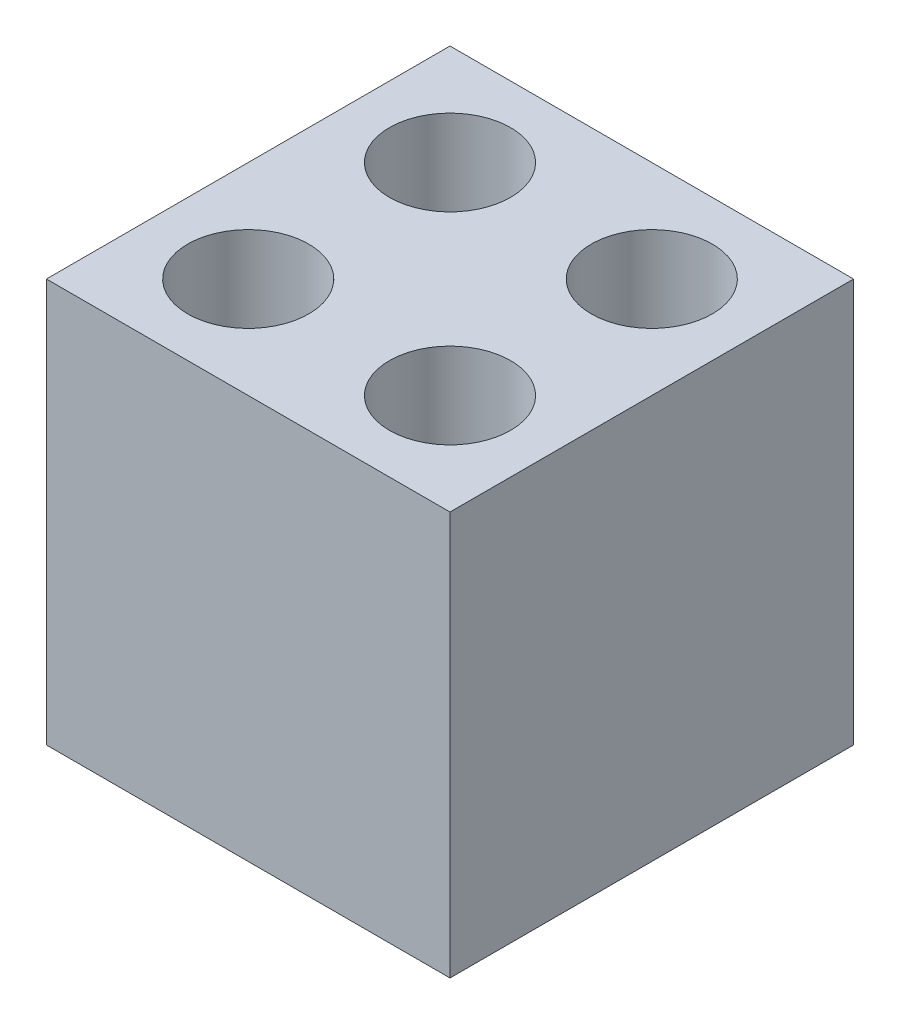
ISO-10303-21;
HEADER;
FILE_DESCRIPTION(('STEP AP214'),'2;1');
FILE_NAME('part.step','',(''),(''),'','','');
FILE_SCHEMA(('AUTOMOTIVE_DESIGN { 1 0 10303 214 1 1 1 1 }'));
ENDSEC;
DATA;
#1=APPLICATION_CONTEXT('core data for automotive mechanical design processes');
#2=APPLICATION_PROTOCOL_DEFINITION('international standard','automotive_design',2000,#1);
#3=PRODUCT_CONTEXT('',#1,'mechanical');
#4=PRODUCT('Part','Part','',(#3));
#5=PRODUCT_RELATED_PRODUCT_CATEGORY('part','',(#4));
#6=PRODUCT_DEFINITION_FORMATION('','',#4);
#7=PRODUCT_DEFINITION_CONTEXT('part definition',#1,'design');
#8=PRODUCT_DEFINITION('design','',#6,#7);
#9=PRODUCT_DEFINITION_SHAPE('','',#8);
#10=(LENGTH_UNIT() NAMED_UNIT(*) SI_UNIT(.MILLI.,.METRE.));
#11=(NAMED_UNIT(*) PLANE_ANGLE_UNIT() SI_UNIT($,.RADIAN.));
#12=(NAMED_UNIT(*) SI_UNIT($,.STERADIAN.) SOLID_ANGLE_UNIT());
#13=UNCERTAINTY_MEASURE_WITH_UNIT(LENGTH_MEASURE(1.E-05),#10,'distance_accuracy_value','');
#14=(GEOMETRIC_REPRESENTATION_CONTEXT(3) GLOBAL_UNCERTAINTY_ASSIGNED_CONTEXT((#13)) GLOBAL_UNIT_ASSIGNED_CONTEXT((#10,
#11,#12)) REPRESENTATION_CONTEXT('',''));
#15=CARTESIAN_POINT('',(0.,0.,0.));
#16=DIRECTION('',(0.,0.,1.));
#17=DIRECTION('',(1.,0.,0.));
#18=AXIS2_PLACEMENT_3D('',#15,#16,#17);
#19=CARTESIAN_POINT('',(-10.,-10.,10.));
#20=DIRECTION('',(-1.,0.,0.));
#21=DIRECTION('',(0.,0.,1.));
#22=AXIS2_PLACEMENT_3D('',#19,#20,#21);
#23=PLANE('',#22);
#24=DIRECTION('',(0.,1.,0.));
#25=VECTOR('',#24,1.);
#26=CARTESIAN_POINT('',(-10.,-10.,-10.));
#27=LINE('',#26,#25);
#28=CARTESIAN_POINT('',(-10.,-10.,-10.));
#29=VERTEX_POINT('',#28);
#30=CARTESIAN_POINT('',(-10.,10.,-10.));
#31=VERTEX_POINT('',#30);
#32=EDGE_CURVE('E102',#29,#31,#27,.T.);
#33=ORIENTED_EDGE('',*,*,#32,.F.);
#34=DIRECTION('',(0.,0.,-1.));
#35=VECTOR('',#34,1.);
#36=CARTESIAN_POINT('',(-10.,-10.,10.));
#37=LINE('',#36,#35);
#38=CARTESIAN_POINT('',(-10.,-10.,10.));
#39=VERTEX_POINT('',#38);
#40=EDGE_CURVE('E11',#39,#29,#37,.T.);
#41=ORIENTED_EDGE('',*,*,#40,.F.);
#42=DIRECTION('',(0.,1.,0.));
#43=VECTOR('',#42,1.);
#44=CARTESIAN_POINT('',(-10.,-10.,10.));
#45=LINE('',#44,#43);
#46=CARTESIAN_POINT('',(-10.,10.,10.));
#47=VERTEX_POINT('',#46);
#48=EDGE_CURVE('E96',#39,#47,#45,.T.);
#49=ORIENTED_EDGE('',*,*,#48,.T.);
#50=DIRECTION('',(0.,0.,-1.));
#51=VECTOR('',#50,1.);
#52=CARTESIAN_POINT('',(-10.,10.,10.));
#53=LINE('',#52,#51);
#54=EDGE_CURVE('E39',#47,#31,#53,.T.);
#55=ORIENTED_EDGE('',*,*,#54,.T.);
#56=EDGE_LOOP('',(#33,#41,#49,#55));
#57=FACE_BOUND('',#56,.T.);
#58=ADVANCED_FACE('F36',(#57),#23,.T.);
#59=CARTESIAN_POINT('',(-10.,-10.,10.));
#60=DIRECTION('',(0.,1.,0.));
#61=DIRECTION('',(0.,0.,1.));
#62=AXIS2_PLACEMENT_3D('',#59,#60,#61);
#63=PLANE('',#62);
#64=CARTESIAN_POINT('',(4.99999999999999,-10.,-5.));
#65=DIRECTION('',(0.,1.,0.));
#66=DIRECTION('',(0.,0.,1.));
#67=AXIS2_PLACEMENT_3D('',#64,#65,#66);
#68=CIRCLE('',#67,2.99999999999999);
#69=CARTESIAN_POINT('',(4.99999999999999,-10.,-2.00000000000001));
#70=VERTEX_POINT('',#69);
#71=EDGE_CURVE('E159',#70,#70,#68,.T.);
#72=ORIENTED_EDGE('',*,*,#71,.T.);
#73=EDGE_LOOP('',(#72));
#74=FACE_BOUND('',#73,.T.);
#75=CARTESIAN_POINT('',(4.99999999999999,-10.,5.));
#76=DIRECTION('',(0.,1.,0.));
#77=DIRECTION('',(0.,0.,1.));
#78=AXIS2_PLACEMENT_3D('',#75,#76,#77);
#79=CIRCLE('',#78,2.99999999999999);
#80=CARTESIAN_POINT('',(4.99999999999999,-10.,7.99999999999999));
#81=VERTEX_POINT('',#80);
#82=EDGE_CURVE('E155',#81,#81,#79,.T.);
#83=ORIENTED_EDGE('',*,*,#82,.T.);
#84=EDGE_LOOP('',(#83));
#85=FACE_BOUND('',#84,.T.);
#86=CARTESIAN_POINT('',(-5.00000000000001,-10.,-5.));
#87=DIRECTION('',(0.,1.,0.));
#88=DIRECTION('',(0.,0.,1.));
#89=AXIS2_PLACEMENT_3D('',#86,#87,#88);
#90=CIRCLE('',#89,3.);
#91=CARTESIAN_POINT('',(-5.00000000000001,-10.,-2.));
#92=VERTEX_POINT('',#91);
#93=EDGE_CURVE('E148',#92,#92,#90,.T.);
#94=ORIENTED_EDGE('',*,*,#93,.T.);
#95=EDGE_LOOP('',(#94));
#96=FACE_BOUND('',#95,.T.);
#97=CARTESIAN_POINT('',(-5.00000000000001,-10.,5.));
#98=DIRECTION('',(0.,1.,0.));
#99=DIRECTION('',(0.,0.,1.));
#100=AXIS2_PLACEMENT_3D('',#97,#98,#99);
#101=CIRCLE('',#100,3.);
#102=CARTESIAN_POINT('',(-5.00000000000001,-10.,7.99999999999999));
#103=VERTEX_POINT('',#102);
#104=EDGE_CURVE('E106',#103,#103,#101,.T.);
#105=ORIENTED_EDGE('',*,*,#104,.T.);
#106=EDGE_LOOP('',(#105));
#107=FACE_BOUND('',#106,.T.);
#108=DIRECTION('',(1.,0.,0.));
#109=VECTOR('',#108,1.);
#110=CARTESIAN_POINT('',(-10.,-10.,-10.));
#111=LINE('',#110,#109);
#112=CARTESIAN_POINT('',(9.99999999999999,-10.,-10.));
#113=VERTEX_POINT('',#112);
#114=EDGE_CURVE('E69',#29,#113,#111,.T.);
#115=ORIENTED_EDGE('',*,*,#114,.T.);
#116=DIRECTION('',(0.,0.,-1.));
#117=VECTOR('',#116,1.);
#118=CARTESIAN_POINT('',(9.99999999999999,-10.,10.));
#119=LINE('',#118,#117);
#120=CARTESIAN_POINT('',(9.99999999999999,-10.,10.));
#121=VERTEX_POINT('',#120);
#122=EDGE_CURVE('E45',#121,#113,#119,.T.);
#123=ORIENTED_EDGE('',*,*,#122,.F.);
#124=DIRECTION('',(1.,0.,0.));
#125=VECTOR('',#124,1.);
#126=CARTESIAN_POINT('',(-10.,-10.,10.));
#127=LINE('',#126,#125);
#128=EDGE_CURVE('E86',#39,#121,#127,.T.);
#129=ORIENTED_EDGE('',*,*,#128,.F.);
#130=ORIENTED_EDGE('',*,*,#40,.T.);
#131=EDGE_LOOP('',(#115,#123,#129,#130));
#132=FACE_BOUND('',#131,.T.);
#133=ADVANCED_FACE('F113',(#74,#85,#96,#107,#132),#63,.F.);
#134=CARTESIAN_POINT('',(9.99999999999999,-10.,10.));
#135=DIRECTION('',(-1.,0.,0.));
#136=DIRECTION('',(0.,0.,1.));
#137=AXIS2_PLACEMENT_3D('',#134,#135,#136);
#138=PLANE('',#137);
#139=DIRECTION('',(0.,1.,0.));
#140=VECTOR('',#139,1.);
#141=CARTESIAN_POINT('',(9.99999999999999,-10.,-10.));
#142=LINE('',#141,#140);
#143=CARTESIAN_POINT('',(9.99999999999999,10.,-10.));
#144=VERTEX_POINT('',#143);
#145=EDGE_CURVE('E93',#113,#144,#142,.T.);
#146=ORIENTED_EDGE('',*,*,#145,.T.);
#147=DIRECTION('',(0.,0.,-1.));
#148=VECTOR('',#147,1.);
#149=CARTESIAN_POINT('',(9.99999999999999,10.,10.));
#150=LINE('',#149,#148);
#151=CARTESIAN_POINT('',(9.99999999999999,10.,10.));
#152=VERTEX_POINT('',#151);
#153=EDGE_CURVE('E90',#152,#144,#150,.T.);
#154=ORIENTED_EDGE('',*,*,#153,.F.);
#155=DIRECTION('',(0.,1.,0.));
#156=VECTOR('',#155,1.);
#157=CARTESIAN_POINT('',(9.99999999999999,-10.,10.));
#158=LINE('',#157,#156);
#159=EDGE_CURVE('E81',#121,#152,#158,.T.);
#160=ORIENTED_EDGE('',*,*,#159,.F.);
#161=ORIENTED_EDGE('',*,*,#122,.T.);
#162=EDGE_LOOP('',(#146,#154,#160,#161));
#163=FACE_BOUND('',#162,.T.);
#164=ADVANCED_FACE('F91',(#163),#138,.F.);
#165=CARTESIAN_POINT('',(-10.,10.,10.));
#166=DIRECTION('',(0.,1.,0.));
#167=DIRECTION('',(0.,0.,1.));
#168=AXIS2_PLACEMENT_3D('',#165,#166,#167);
#169=PLANE('',#168);
#170=CARTESIAN_POINT('',(4.99999999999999,10.,-5.));
#171=DIRECTION('',(0.,1.,0.));
#172=DIRECTION('',(0.,0.,1.));
#173=AXIS2_PLACEMENT_3D('',#170,#171,#172);
#174=CIRCLE('',#173,2.99999999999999);
#175=CARTESIAN_POINT('',(4.99999999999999,10.,-2.00000000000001));
#176=VERTEX_POINT('',#175);
#177=EDGE_CURVE('E135',#176,#176,#174,.T.);
#178=ORIENTED_EDGE('',*,*,#177,.F.);
#179=EDGE_LOOP('',(#178));
#180=FACE_BOUND('',#179,.T.);
#181=CARTESIAN_POINT('',(4.99999999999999,10.,5.));
#182=DIRECTION('',(0.,1.,0.));
#183=DIRECTION('',(0.,0.,1.));
#184=AXIS2_PLACEMENT_3D('',#181,#182,#183);
#185=CIRCLE('',#184,2.99999999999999);
#186=CARTESIAN_POINT('',(4.99999999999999,10.,7.99999999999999));
#187=VERTEX_POINT('',#186);
#188=EDGE_CURVE('E139',#187,#187,#185,.T.);
#189=ORIENTED_EDGE('',*,*,#188,.F.);
#190=EDGE_LOOP('',(#189));
#191=FACE_BOUND('',#190,.T.);
#192=CARTESIAN_POINT('',(-5.00000000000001,10.,-5.));
#193=DIRECTION('',(0.,1.,0.));
#194=DIRECTION('',(0.,0.,1.));
#195=AXIS2_PLACEMENT_3D('',#192,#193,#194);
#196=CIRCLE('',#195,3.);
#197=CARTESIAN_POINT('',(-5.00000000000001,10.,-2.));
#198=VERTEX_POINT('',#197);
#199=EDGE_CURVE('E143',#198,#198,#196,.T.);
#200=ORIENTED_EDGE('',*,*,#199,.F.);
#201=EDGE_LOOP('',(#200));
#202=FACE_BOUND('',#201,.T.);
#203=CARTESIAN_POINT('',(-5.00000000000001,10.,5.));
#204=DIRECTION('',(0.,1.,0.));
#205=DIRECTION('',(0.,0.,1.));
#206=AXIS2_PLACEMENT_3D('',#203,#204,#205);
#207=CIRCLE('',#206,3.);
#208=CARTESIAN_POINT('',(-5.00000000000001,10.,8.));
#209=VERTEX_POINT('',#208);
#210=EDGE_CURVE('E146',#209,#209,#207,.T.);
#211=ORIENTED_EDGE('',*,*,#210,.F.);
#212=EDGE_LOOP('',(#211));
#213=FACE_BOUND('',#212,.T.);
#214=DIRECTION('',(1.,0.,0.));
#215=VECTOR('',#214,1.);
#216=CARTESIAN_POINT('',(-10.,10.,-10.));
#217=LINE('',#216,#215);
#218=EDGE_CURVE('E105',#31,#144,#217,.T.);
#219=ORIENTED_EDGE('',*,*,#218,.F.);
#220=ORIENTED_EDGE('',*,*,#54,.F.);
#221=DIRECTION('',(1.,0.,0.));
#222=VECTOR('',#221,1.);
#223=CARTESIAN_POINT('',(-10.,10.,10.));
#224=LINE('',#223,#222);
#225=EDGE_CURVE('E85',#47,#152,#224,.T.);
#226=ORIENTED_EDGE('',*,*,#225,.T.);
#227=ORIENTED_EDGE('',*,*,#153,.T.);
#228=EDGE_LOOP('',(#219,#220,#226,#227));
#229=FACE_BOUND('',#228,.T.);
#230=ADVANCED_FACE('F95',(#180,#191,#202,#213,#229),#169,.T.);
#231=CARTESIAN_POINT('',(0.,0.,10.));
#232=DIRECTION('',(0.,0.,-1.));
#233=DIRECTION('',(-1.,0.,0.));
#234=AXIS2_PLACEMENT_3D('',#231,#232,#233);
#235=PLANE('',#234);
#236=ORIENTED_EDGE('',*,*,#48,.F.);
#237=ORIENTED_EDGE('',*,*,#128,.T.);
#238=ORIENTED_EDGE('',*,*,#159,.T.);
#239=ORIENTED_EDGE('',*,*,#225,.F.);
#240=EDGE_LOOP('',(#236,#237,#238,#239));
#241=FACE_BOUND('',#240,.T.);
#242=ADVANCED_FACE('F84',(#241),#235,.F.);
#243=CARTESIAN_POINT('',(0.,0.,-10.));
#244=DIRECTION('',(0.,0.,-1.));
#245=DIRECTION('',(-1.,0.,0.));
#246=AXIS2_PLACEMENT_3D('',#243,#244,#245);
#247=PLANE('',#246);
#248=ORIENTED_EDGE('',*,*,#32,.T.);
#249=ORIENTED_EDGE('',*,*,#218,.T.);
#250=ORIENTED_EDGE('',*,*,#145,.F.);
#251=ORIENTED_EDGE('',*,*,#114,.F.);
#252=EDGE_LOOP('',(#248,#249,#250,#251));
#253=FACE_BOUND('',#252,.T.);
#254=ADVANCED_FACE('F111',(#253),#247,.T.);
#255=CARTESIAN_POINT('',(-5.00000000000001,10.,5.));
#256=DIRECTION('',(0.,1.,0.));
#257=DIRECTION('',(0.,0.,1.));
#258=AXIS2_PLACEMENT_3D('',#255,#256,#257);
#259=CYLINDRICAL_SURFACE('',#258,3.);
#260=ORIENTED_EDGE('',*,*,#104,.F.);
#261=EDGE_LOOP('',(#260));
#262=FACE_BOUND('',#261,.T.);
#263=ORIENTED_EDGE('',*,*,#210,.T.);
#264=EDGE_LOOP('',(#263));
#265=FACE_BOUND('',#264,.T.);
#266=ADVANCED_FACE('F177',(#262,#265),#259,.F.);
#267=CARTESIAN_POINT('',(-5.00000000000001,10.,-5.));
#268=DIRECTION('',(0.,1.,0.));
#269=DIRECTION('',(0.,0.,1.));
#270=AXIS2_PLACEMENT_3D('',#267,#268,#269);
#271=CYLINDRICAL_SURFACE('',#270,3.);
#272=ORIENTED_EDGE('',*,*,#93,.F.);
#273=EDGE_LOOP('',(#272));
#274=FACE_BOUND('',#273,.T.);
#275=ORIENTED_EDGE('',*,*,#199,.T.);
#276=EDGE_LOOP('',(#275));
#277=FACE_BOUND('',#276,.T.);
#278=ADVANCED_FACE('F170',(#274,#277),#271,.F.);
#279=CARTESIAN_POINT('',(4.99999999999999,10.,5.));
#280=DIRECTION('',(0.,1.,0.));
#281=DIRECTION('',(0.,0.,1.));
#282=AXIS2_PLACEMENT_3D('',#279,#280,#281);
#283=CYLINDRICAL_SURFACE('',#282,2.99999999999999);
#284=ORIENTED_EDGE('',*,*,#82,.F.);
#285=EDGE_LOOP('',(#284));
#286=FACE_BOUND('',#285,.T.);
#287=ORIENTED_EDGE('',*,*,#188,.T.);
#288=EDGE_LOOP('',(#287));
#289=FACE_BOUND('',#288,.T.);
#290=ADVANCED_FACE('F164',(#286,#289),#283,.F.);
#291=CARTESIAN_POINT('',(4.99999999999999,10.,-5.));
#292=DIRECTION('',(0.,1.,0.));
#293=DIRECTION('',(0.,0.,1.));
#294=AXIS2_PLACEMENT_3D('',#291,#292,#293);
#295=CYLINDRICAL_SURFACE('',#294,2.99999999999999);
#296=ORIENTED_EDGE('',*,*,#71,.F.);
#297=EDGE_LOOP('',(#296));
#298=FACE_BOUND('',#297,.T.);
#299=ORIENTED_EDGE('',*,*,#177,.T.);
#300=EDGE_LOOP('',(#299));
#301=FACE_BOUND('',#300,.T.);
#302=ADVANCED_FACE('F162',(#298,#301),#295,.F.);
#303=CLOSED_SHELL('',(#58,#133,#164,#230,#242,#254,#266,#278,#290,#302));
#304=MANIFOLD_SOLID_BREP('B2',#303);
#305=ADVANCED_BREP_SHAPE_REPRESENTATION('',(#18,#304),#14);
#306=SHAPE_DEFINITION_REPRESENTATION(#9,#305);
ENDSEC;
END-ISO-10303-21;
